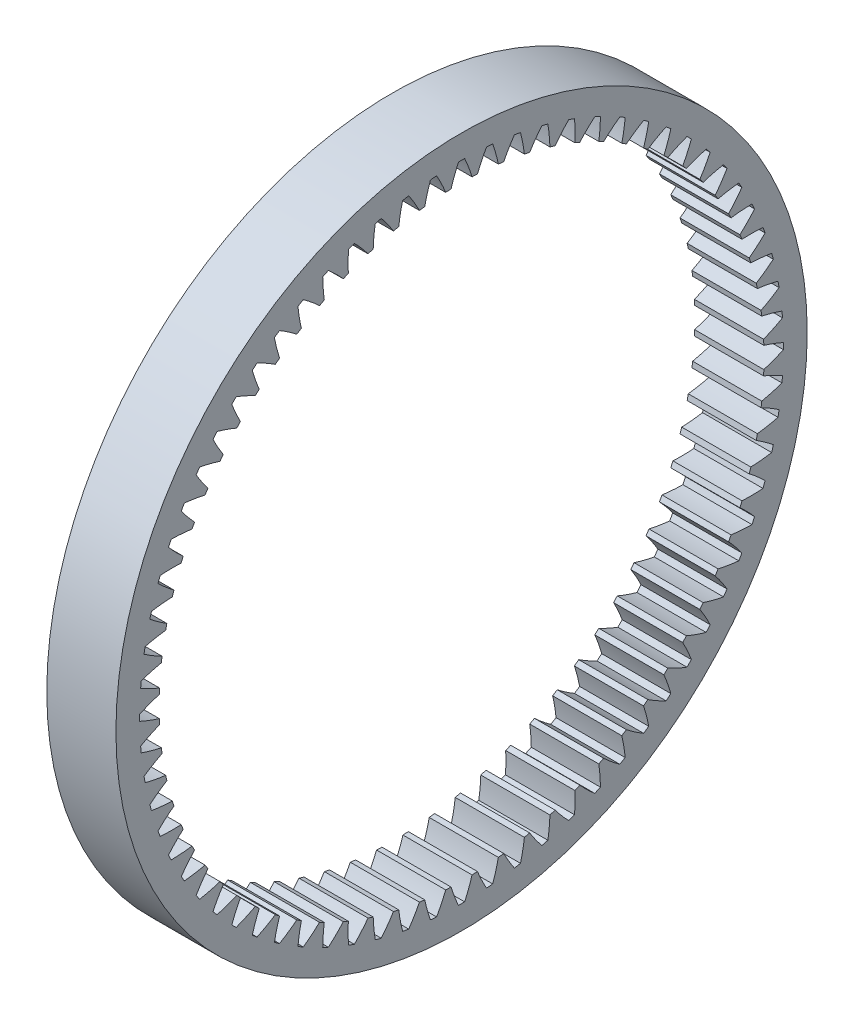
from build123d import *

# Parameters (mm, degrees)
BASPROSKE_W     = 50.8
BASPROSKE_H     = 31.75
TOOTHCUT_DEPTH  = 363.78456417
TEETHCUTS_COUNT = 72
TEETHCUTS_ANGLE = 355


with BuildPart() as part:
    # BasProSke → Base-Revolve (revolve)
    with BuildSketch(Plane(origin=(0, 0, 0), x_dir=(1, 0, 0), z_dir=(0, 1, 0)), mode=Mode.PRIVATE) as base_revolve_sk:
        with Locations((25.4, 238.125)):
            Rectangle(BASPROSKE_W, BASPROSKE_H)
    revolve(base_revolve_sk.sketch.rotate(Axis((-10, 0, 0), (1, 0, 0)), 180), axis=Axis((-10, 0, 0), (1, 0, 0)))

    # TooCutSke → ToothCut (cut, through all)
    with BuildSketch(Plane(origin=(0, 0, 0), x_dir=(0, 0, -1), z_dir=(1, 0, 0))):
        with BuildLine():
            ThreePointArc((7.712692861, 222.090718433), (5.234801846, 229.401259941), (2.269137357, 236.527885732))
            ThreePointArc((2.269137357, 236.527885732), (0, 236.53877), (-2.269137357, 236.527885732))
            ThreePointArc((-2.269137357, 236.527885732), (-5.234801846, 229.401259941), (-7.712692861, 222.090718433))
            ThreePointArc((-7.712692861, 222.090718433), (0, 222.2246), (7.712692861, 222.090718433))
        make_face()
    toothcut = extrude(amount=TOOTHCUT_DEPTH, mode=Mode.SUBTRACT)

    # TeethCuts: ToothCut ×72 about axis
    teethcuts_axis = Axis((-10, 0, 0), (1, 0, 0))
    for i in range(1, TEETHCUTS_COUNT):
        add(toothcut.rotate(teethcuts_axis, i * TEETHCUTS_ANGLE / (TEETHCUTS_COUNT - 1)), mode=Mode.SUBTRACT)


solid = part.part
